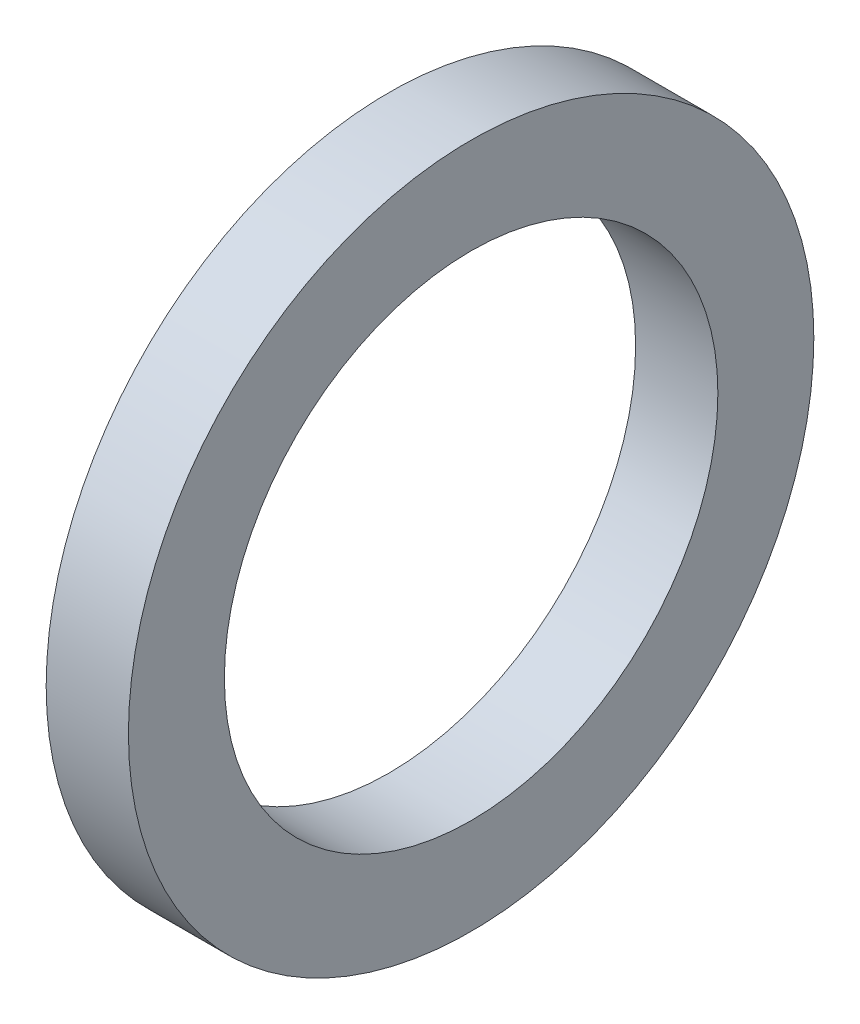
from build123d import *

# Parameters (mm, degrees)
SKETCH1_W = 6
SKETCH1_H = 7


with BuildPart() as part:
    # Sketch1 → Base-Revolve (revolve)
    with BuildSketch(Plane.XY, mode=Mode.PRIVATE) as base_revolve_sk:
        with Locations((-3, 21.5)):
            Rectangle(SKETCH1_W, SKETCH1_H)
    revolve(base_revolve_sk.sketch.rotate(Axis((-34.925, 0, 0), (1, 0, 0)), 90), axis=Axis((-34.925, 0, 0), (1, 0, 0)))


solid = part.part
